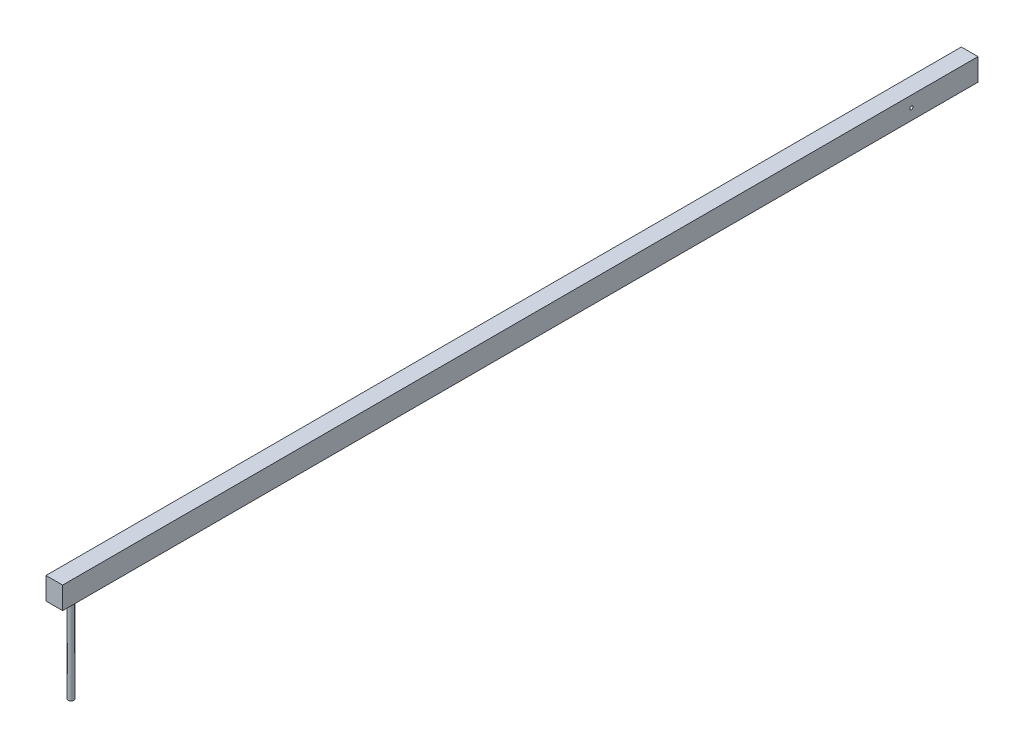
ISO-10303-21;
HEADER;
FILE_DESCRIPTION(('STEP AP214'),'2;1');
FILE_NAME('part.step','',(''),(''),'','','');
FILE_SCHEMA(('AUTOMOTIVE_DESIGN { 1 0 10303 214 1 1 1 1 }'));
ENDSEC;
DATA;
#1=APPLICATION_CONTEXT('core data for automotive mechanical design processes');
#2=APPLICATION_PROTOCOL_DEFINITION('international standard','automotive_design',2000,#1);
#3=PRODUCT_CONTEXT('',#1,'mechanical');
#4=PRODUCT('Part','Part','',(#3));
#5=PRODUCT_RELATED_PRODUCT_CATEGORY('part','',(#4));
#6=PRODUCT_DEFINITION_FORMATION('','',#4);
#7=PRODUCT_DEFINITION_CONTEXT('part definition',#1,'design');
#8=PRODUCT_DEFINITION('design','',#6,#7);
#9=PRODUCT_DEFINITION_SHAPE('','',#8);
#10=(LENGTH_UNIT() NAMED_UNIT(*) SI_UNIT(.MILLI.,.METRE.));
#11=(NAMED_UNIT(*) PLANE_ANGLE_UNIT() SI_UNIT($,.RADIAN.));
#12=(NAMED_UNIT(*) SI_UNIT($,.STERADIAN.) SOLID_ANGLE_UNIT());
#13=UNCERTAINTY_MEASURE_WITH_UNIT(LENGTH_MEASURE(1.E-05),#10,'distance_accuracy_value','');
#14=(GEOMETRIC_REPRESENTATION_CONTEXT(3) GLOBAL_UNCERTAINTY_ASSIGNED_CONTEXT((#13)) GLOBAL_UNIT_ASSIGNED_CONTEXT((#10,
#11,#12)) REPRESENTATION_CONTEXT('',''));
#15=CARTESIAN_POINT('',(0.,0.,0.));
#16=DIRECTION('',(0.,0.,1.));
#17=DIRECTION('',(1.,0.,0.));
#18=AXIS2_PLACEMENT_3D('',#15,#16,#17);
#19=CARTESIAN_POINT('',(-15.,-20.,825.));
#20=DIRECTION('',(1.,0.,0.));
#21=DIRECTION('',(0.,0.,-1.));
#22=AXIS2_PLACEMENT_3D('',#19,#20,#21);
#23=PLANE('',#22);
#24=CARTESIAN_POINT('',(-15.,0.,-705.));
#25=DIRECTION('',(1.,0.,0.));
#26=DIRECTION('',(0.,0.,-1.));
#27=AXIS2_PLACEMENT_3D('',#24,#25,#26);
#28=CIRCLE('',#27,3.00000000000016);
#29=CARTESIAN_POINT('',(-15.,0.,-708.));
#30=VERTEX_POINT('',#29);
#31=EDGE_CURVE('E115',#30,#30,#28,.T.);
#32=ORIENTED_EDGE('',*,*,#31,.T.);
#33=EDGE_LOOP('',(#32));
#34=FACE_BOUND('',#33,.T.);
#35=DIRECTION('',(0.,-1.,0.));
#36=VECTOR('',#35,1.);
#37=CARTESIAN_POINT('',(-15.,-20.,-825.));
#38=LINE('',#37,#36);
#39=CARTESIAN_POINT('',(-15.,20.,-825.));
#40=VERTEX_POINT('',#39);
#41=CARTESIAN_POINT('',(-15.,-20.,-825.));
#42=VERTEX_POINT('',#41);
#43=EDGE_CURVE('E96',#40,#42,#38,.T.);
#44=ORIENTED_EDGE('',*,*,#43,.T.);
#45=DIRECTION('',(0.,0.,-1.));
#46=VECTOR('',#45,1.);
#47=CARTESIAN_POINT('',(-15.,-20.,825.));
#48=LINE('',#47,#46);
#49=CARTESIAN_POINT('',(-15.,-20.,825.));
#50=VERTEX_POINT('',#49);
#51=EDGE_CURVE('E11',#50,#42,#48,.T.);
#52=ORIENTED_EDGE('',*,*,#51,.F.);
#53=DIRECTION('',(0.,-1.,0.));
#54=VECTOR('',#53,1.);
#55=CARTESIAN_POINT('',(-15.,-20.,825.));
#56=LINE('',#55,#54);
#57=CARTESIAN_POINT('',(-15.,20.,825.));
#58=VERTEX_POINT('',#57);
#59=EDGE_CURVE('E84',#58,#50,#56,.T.);
#60=ORIENTED_EDGE('',*,*,#59,.F.);
#61=DIRECTION('',(0.,0.,-1.));
#62=VECTOR('',#61,1.);
#63=CARTESIAN_POINT('',(-15.,20.,825.));
#64=LINE('',#63,#62);
#65=EDGE_CURVE('E92',#58,#40,#64,.T.);
#66=ORIENTED_EDGE('',*,*,#65,.T.);
#67=EDGE_LOOP('',(#44,#52,#60,#66));
#68=FACE_BOUND('',#67,.T.);
#69=ADVANCED_FACE('F33',(#34,#68),#23,.F.);
#70=CARTESIAN_POINT('',(15.,-20.,825.));
#71=DIRECTION('',(0.,1.,0.));
#72=DIRECTION('',(0.,0.,1.));
#73=AXIS2_PLACEMENT_3D('',#70,#71,#72);
#74=PLANE('',#73);
#75=CARTESIAN_POINT('',(0.,-20.,795.));
#76=DIRECTION('',(0.,1.,0.));
#77=DIRECTION('',(0.,0.,1.));
#78=AXIS2_PLACEMENT_3D('',#75,#76,#77);
#79=CIRCLE('',#78,5.00000000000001);
#80=CARTESIAN_POINT('',(0.,-20.,800.));
#81=VERTEX_POINT('',#80);
#82=EDGE_CURVE('E99',#81,#81,#79,.T.);
#83=ORIENTED_EDGE('',*,*,#82,.T.);
#84=EDGE_LOOP('',(#83));
#85=FACE_BOUND('',#84,.T.);
#86=DIRECTION('',(1.,0.,0.));
#87=VECTOR('',#86,1.);
#88=CARTESIAN_POINT('',(15.,-20.,-825.));
#89=LINE('',#88,#87);
#90=CARTESIAN_POINT('',(15.,-20.,-825.));
#91=VERTEX_POINT('',#90);
#92=EDGE_CURVE('E88',#42,#91,#89,.T.);
#93=ORIENTED_EDGE('',*,*,#92,.T.);
#94=DIRECTION('',(0.,0.,-1.));
#95=VECTOR('',#94,1.);
#96=CARTESIAN_POINT('',(15.,-20.,825.));
#97=LINE('',#96,#95);
#98=CARTESIAN_POINT('',(15.,-20.,825.));
#99=VERTEX_POINT('',#98);
#100=EDGE_CURVE('E41',#99,#91,#97,.T.);
#101=ORIENTED_EDGE('',*,*,#100,.F.);
#102=DIRECTION('',(1.,0.,0.));
#103=VECTOR('',#102,1.);
#104=CARTESIAN_POINT('',(15.,-20.,825.));
#105=LINE('',#104,#103);
#106=EDGE_CURVE('E79',#50,#99,#105,.T.);
#107=ORIENTED_EDGE('',*,*,#106,.F.);
#108=ORIENTED_EDGE('',*,*,#51,.T.);
#109=EDGE_LOOP('',(#93,#101,#107,#108));
#110=FACE_BOUND('',#109,.T.);
#111=ADVANCED_FACE('F87',(#85,#110),#74,.F.);
#112=CARTESIAN_POINT('',(15.,-20.,825.));
#113=DIRECTION('',(-1.,0.,0.));
#114=DIRECTION('',(0.,-1.,0.));
#115=AXIS2_PLACEMENT_3D('',#112,#113,#114);
#116=PLANE('',#115);
#117=CARTESIAN_POINT('',(15.,0.,-705.));
#118=DIRECTION('',(-1.,0.,0.));
#119=DIRECTION('',(0.,0.,1.));
#120=AXIS2_PLACEMENT_3D('',#117,#118,#119);
#121=CIRCLE('',#120,3.00000000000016);
#122=CARTESIAN_POINT('',(15.,0.,-702.));
#123=VERTEX_POINT('',#122);
#124=EDGE_CURVE('E118',#123,#123,#121,.T.);
#125=ORIENTED_EDGE('',*,*,#124,.T.);
#126=EDGE_LOOP('',(#125));
#127=FACE_BOUND('',#126,.T.);
#128=DIRECTION('',(0.,1.,0.));
#129=VECTOR('',#128,1.);
#130=CARTESIAN_POINT('',(15.,-20.,-825.));
#131=LINE('',#130,#129);
#132=CARTESIAN_POINT('',(15.,20.,-825.));
#133=VERTEX_POINT('',#132);
#134=EDGE_CURVE('E66',#91,#133,#131,.T.);
#135=ORIENTED_EDGE('',*,*,#134,.T.);
#136=DIRECTION('',(0.,0.,-1.));
#137=VECTOR('',#136,1.);
#138=CARTESIAN_POINT('',(15.,20.,825.));
#139=LINE('',#138,#137);
#140=CARTESIAN_POINT('',(15.,20.,825.));
#141=VERTEX_POINT('',#140);
#142=EDGE_CURVE('E89',#141,#133,#139,.T.);
#143=ORIENTED_EDGE('',*,*,#142,.F.);
#144=DIRECTION('',(0.,1.,0.));
#145=VECTOR('',#144,1.);
#146=CARTESIAN_POINT('',(15.,-20.,825.));
#147=LINE('',#146,#145);
#148=EDGE_CURVE('E82',#99,#141,#147,.T.);
#149=ORIENTED_EDGE('',*,*,#148,.F.);
#150=ORIENTED_EDGE('',*,*,#100,.T.);
#151=EDGE_LOOP('',(#135,#143,#149,#150));
#152=FACE_BOUND('',#151,.T.);
#153=ADVANCED_FACE('F90',(#127,#152),#116,.F.);
#154=CARTESIAN_POINT('',(15.,20.,825.));
#155=DIRECTION('',(0.,-1.,0.));
#156=DIRECTION('',(0.,0.,-1.));
#157=AXIS2_PLACEMENT_3D('',#154,#155,#156);
#158=PLANE('',#157);
#159=DIRECTION('',(-1.,0.,0.));
#160=VECTOR('',#159,1.);
#161=CARTESIAN_POINT('',(15.,20.,-825.));
#162=LINE('',#161,#160);
#163=EDGE_CURVE('E72',#133,#40,#162,.T.);
#164=ORIENTED_EDGE('',*,*,#163,.T.);
#165=ORIENTED_EDGE('',*,*,#65,.F.);
#166=DIRECTION('',(-1.,0.,0.));
#167=VECTOR('',#166,1.);
#168=CARTESIAN_POINT('',(15.,20.,825.));
#169=LINE('',#168,#167);
#170=EDGE_CURVE('E49',#141,#58,#169,.T.);
#171=ORIENTED_EDGE('',*,*,#170,.F.);
#172=ORIENTED_EDGE('',*,*,#142,.T.);
#173=EDGE_LOOP('',(#164,#165,#171,#172));
#174=FACE_BOUND('',#173,.T.);
#175=ADVANCED_FACE('F104',(#174),#158,.F.);
#176=CARTESIAN_POINT('',(0.,0.,825.));
#177=DIRECTION('',(0.,0.,1.));
#178=DIRECTION('',(1.,0.,0.));
#179=AXIS2_PLACEMENT_3D('',#176,#177,#178);
#180=PLANE('',#179);
#181=ORIENTED_EDGE('',*,*,#59,.T.);
#182=ORIENTED_EDGE('',*,*,#106,.T.);
#183=ORIENTED_EDGE('',*,*,#148,.T.);
#184=ORIENTED_EDGE('',*,*,#170,.T.);
#185=EDGE_LOOP('',(#181,#182,#183,#184));
#186=FACE_BOUND('',#185,.T.);
#187=ADVANCED_FACE('F80',(#186),#180,.T.);
#188=CARTESIAN_POINT('',(0.,0.,-825.));
#189=DIRECTION('',(0.,0.,1.));
#190=DIRECTION('',(1.,0.,0.));
#191=AXIS2_PLACEMENT_3D('',#188,#189,#190);
#192=PLANE('',#191);
#193=ORIENTED_EDGE('',*,*,#43,.F.);
#194=ORIENTED_EDGE('',*,*,#163,.F.);
#195=ORIENTED_EDGE('',*,*,#134,.F.);
#196=ORIENTED_EDGE('',*,*,#92,.F.);
#197=EDGE_LOOP('',(#193,#194,#195,#196));
#198=FACE_BOUND('',#197,.T.);
#199=ADVANCED_FACE('F107',(#198),#192,.F.);
#200=CARTESIAN_POINT('',(0.,-180.,795.));
#201=DIRECTION('',(0.,1.,0.));
#202=DIRECTION('',(0.,0.,1.));
#203=AXIS2_PLACEMENT_3D('',#200,#201,#202);
#204=CYLINDRICAL_SURFACE('',#203,5.00000000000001);
#205=CARTESIAN_POINT('',(0.,-180.,795.));
#206=DIRECTION('',(0.,1.,0.));
#207=DIRECTION('',(0.,0.,1.));
#208=AXIS2_PLACEMENT_3D('',#205,#206,#207);
#209=CIRCLE('',#208,5.00000000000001);
#210=CARTESIAN_POINT('',(0.,-180.,800.));
#211=VERTEX_POINT('',#210);
#212=EDGE_CURVE('E112',#211,#211,#209,.T.);
#213=ORIENTED_EDGE('',*,*,#212,.T.);
#214=EDGE_LOOP('',(#213));
#215=FACE_BOUND('',#214,.T.);
#216=ORIENTED_EDGE('',*,*,#82,.F.);
#217=EDGE_LOOP('',(#216));
#218=FACE_BOUND('',#217,.T.);
#219=ADVANCED_FACE('F144',(#215,#218),#204,.T.);
#220=CARTESIAN_POINT('',(0.,-180.,795.));
#221=DIRECTION('',(0.,1.,0.));
#222=DIRECTION('',(0.,0.,1.));
#223=AXIS2_PLACEMENT_3D('',#220,#221,#222);
#224=PLANE('',#223);
#225=ORIENTED_EDGE('',*,*,#212,.F.);
#226=EDGE_LOOP('',(#225));
#227=FACE_BOUND('',#226,.T.);
#228=ADVANCED_FACE('F126',(#227),#224,.F.);
#229=CARTESIAN_POINT('',(15.,0.,-705.));
#230=DIRECTION('',(-1.,0.,0.));
#231=DIRECTION('',(0.,0.,1.));
#232=AXIS2_PLACEMENT_3D('',#229,#230,#231);
#233=CYLINDRICAL_SURFACE('',#232,3.00000000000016);
#234=ORIENTED_EDGE('',*,*,#124,.F.);
#235=EDGE_LOOP('',(#234));
#236=FACE_BOUND('',#235,.T.);
#237=ORIENTED_EDGE('',*,*,#31,.F.);
#238=EDGE_LOOP('',(#237));
#239=FACE_BOUND('',#238,.T.);
#240=ADVANCED_FACE('F123',(#236,#239),#233,.F.);
#241=CLOSED_SHELL('',(#69,#111,#153,#175,#187,#199,#219,#228,#240));
#242=MANIFOLD_SOLID_BREP('B2',#241);
#243=ADVANCED_BREP_SHAPE_REPRESENTATION('',(#18,#242),#14);
#244=SHAPE_DEFINITION_REPRESENTATION(#9,#243);
ENDSEC;
END-ISO-10303-21;
